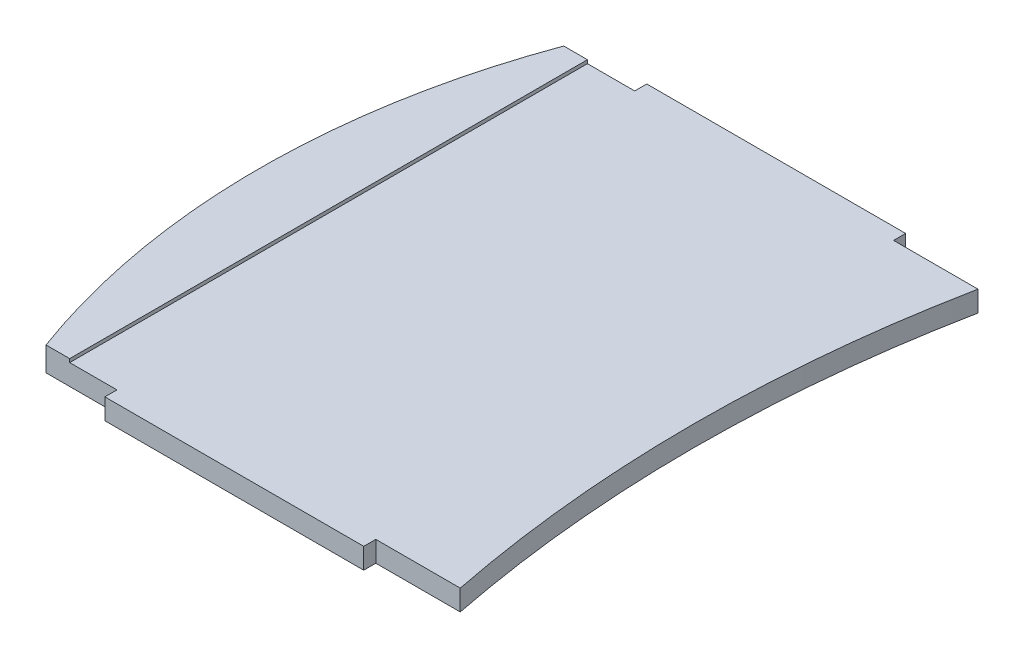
from build123d import *

# Parameters (mm, degrees)
BOSS_EXTRUDE1_DEPTH = 12
BOSS_EXTRUDE2_DEPTH = 14
CUT_EXTRUDE2_DEPTH  = 14
CUT_EXTRUDE3_DEPTH  = 14
CUT_EXTRUDE4_DEPTH  = 14
BOSS_EXTRUDE4_DEPTH = 14
CUT_EXTRUDE6_DEPTH  = 14


with BuildPart() as part:
    # Sketch1 → Boss-Extrude1 (new body)
    with BuildSketch(Plane(origin=(0, 0, 0), x_dir=(1, 0, 0), z_dir=(0, 1, 0))):
        Polygon((-239.016217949, 182.316442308), (-239.016217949, -117.683557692), (-177.216217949, -117.683557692), (-177.216217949, -124.683557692), (-27.216217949, -124.683557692), (-27.216217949, -117.683557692), (45.613782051, -117.683557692), (45.613782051, 182.316442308), (-27.216217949, 182.316442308), (-27.216217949, 189.316442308), (-177.216217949, 189.316442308), (-177.216217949, 182.316442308), align=None)
    extrude(amount=BOSS_EXTRUDE1_DEPTH)

    # Sketch2 → Boss-Extrude2 (add)
    with BuildSketch(Plane.XZ):
        with BuildLine():
            Line((-239.016217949, 117.683557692), (-239.016217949, -182.316442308))
            ThreePointArc((-239.016217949, -182.316442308), (-271.394111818, -32.316442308), (-239.016217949, 117.683557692))
        make_face()
    extrude(amount=-BOSS_EXTRUDE2_DEPTH)

    # Sketch4 → Cut-Extrude2 (cut)
    with BuildSketch(Plane.XZ):
        with BuildLine():
            Line((-231.956217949, 117.683557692), (-231.956217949, 156.673362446))
            Line((-231.956217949, 156.673362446), (-361.984360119, 13.971443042))
            Line((-361.984360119, 13.971443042), (-301.732438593, -154.892494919))
            Line((-301.732438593, -154.892494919), (-263.852348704, -210.045351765))
            Line((-263.852348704, -210.045351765), (-231.956217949, -182.316442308))
            ThreePointArc((-231.956217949, -182.316442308), (-271.394111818, -32.316442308), (-231.956217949, 117.683557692))
        make_face()
    extrude(amount=-CUT_EXTRUDE2_DEPTH, mode=Mode.SUBTRACT)

    # Sketch5 → Cut-Extrude3 (cut)
    with BuildSketch(Plane.XZ):
        Polygon((21.703782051, 117.683557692), (70.657487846, 137.826693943), (78.569465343, -196.7369259), (21.703782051, -196.7369259), (21.703782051, -182.316442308), align=None)
    extrude(amount=-CUT_EXTRUDE3_DEPTH, mode=Mode.SUBTRACT)

    # Sketch6 → Cut-Extrude4 (cut)
    with BuildSketch(Plane.XZ):
        with BuildLine():
            Line((-204.586217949, 117.683557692), (-222.340572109, 193.577821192))
            Line((-222.340572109, 193.577821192), (-399.94789063, -71.218544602))
            Line((-399.94789063, -71.218544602), (-232.321963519, -239.138191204))
            Line((-232.321963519, -239.138191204), (-204.586217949, -182.316442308))
            ThreePointArc((-204.586217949, -182.316442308), (-232.321963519, -32.316442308), (-204.586217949, 117.683557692))
        make_face()
    extrude(amount=-CUT_EXTRUDE4_DEPTH, mode=Mode.SUBTRACT)

    # Sketch9 → Boss-Extrude4 (add)
    with BuildSketch(Plane.XZ):
        with BuildLine():
            Line((-204.586217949, 117.683557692), (-218.313277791, 117.683557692))
            ThreePointArc((-218.313277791, 117.683557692), (-245.067759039, -32.316442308), (-218.313277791, -182.316442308))
            Line((-218.313277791, -182.316442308), (-204.586217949, -182.316442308))
            Line((-204.586217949, -182.316442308), (-204.586217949, 117.683557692))
        make_face()
    extrude(amount=-BOSS_EXTRUDE4_DEPTH)

    # Sketch10 → Cut-Extrude6 (cut)
    with BuildSketch(Plane(origin=(0, 0, 0), x_dir=(-1, 0, 0), z_dir=(0, -1, 0))):
        with BuildLine():
            Line((-21.703782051, -117.683557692), (-21.703782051, 182.316442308))
            ThreePointArc((-21.703782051, 182.316442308), (-6.931782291, 32.316442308), (-21.703782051, -117.683557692))
        make_face()
    extrude(amount=-CUT_EXTRUDE6_DEPTH, mode=Mode.SUBTRACT)


solid = part.part
